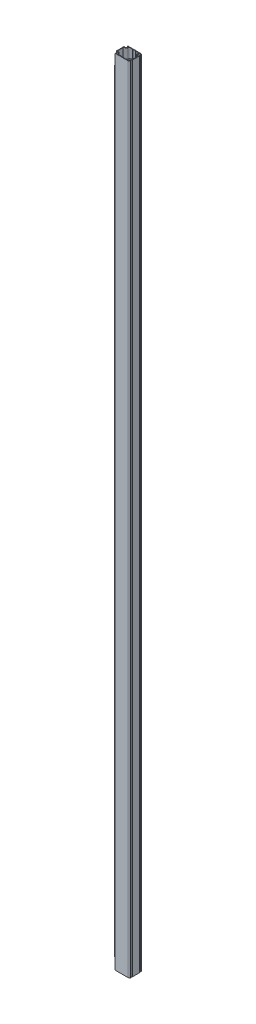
from build123d import *

# Parameters (mm, degrees)
SALIENTE_EXTRUIR2_DEPTH = 5000
CROQUIS3_W              = 12.11476064
CROQUIS3_H              = 9.5
CROQUIS3_W_2            = 14.082897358
CROQUIS3_H_2            = 15.016925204
CORTAR_EXTRUIR1_DEPTH   = 70
CROQUIS4_W              = 16.33693279
CROQUIS4_H              = 12.48072402
CROQUIS4_W_2            = 14.218786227
CROQUIS4_H_2            = 9.5
CORTAR_EXTRUIR2_DEPTH   = 70


with BuildPart() as part:
    # Croquis2 → Saliente-Extruir2 (new body)
    with BuildSketch(Plane(origin=(0, 0, 0), x_dir=(1, 0, 0), z_dir=(0, 1, 0))):
        with BuildLine():
            Line((40.5, 40), (-40.5, 40))
            ThreePointArc((-40.5, 40), (-46.389741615, 37.953921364), (-49.742457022, 32.69704078))
            ThreePointArc((-49.742457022, 32.69704078), (-48.630022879, 30.890804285), (-46.823786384, 32.003238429))
            ThreePointArc((-46.823786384, 32.003238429), (-34.495655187, 32.989546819), (-43.904761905, 24.96306977))
            ThreePointArc((-43.904761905, 24.96306977), (-47.951800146, 25.047214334), (-50, 21.55572809))
            Line((-50, 21.55572809), (-50, -21.55572809))
            ThreePointArc((-50, -21.55572809), (-47.951800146, -25.047214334), (-43.904761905, -24.96306977))
            ThreePointArc((-43.904761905, -24.96306977), (-34.495655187, -32.989546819), (-46.823786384, -32.003238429))
            ThreePointArc((-46.823786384, -32.003238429), (-48.630022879, -30.890804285), (-49.742457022, -32.69704078))
            ThreePointArc((-49.742457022, -32.69704078), (-46.389741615, -37.953921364), (-40.5, -40))
            Line((-40.5, -40), (40.5, -40))
            ThreePointArc((40.5, -40), (46.389741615, -37.953921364), (49.742457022, -32.69704078))
            ThreePointArc((49.742457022, -32.69704078), (48.630022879, -30.890804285), (46.823786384, -32.003238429))
            ThreePointArc((46.823786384, -32.003238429), (34.495655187, -32.989546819), (43.904761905, -24.96306977))
            ThreePointArc((43.904761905, -24.96306977), (47.951800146, -25.047214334), (50, -21.55572809))
            Line((50, -21.55572809), (50, 21.55572809))
            ThreePointArc((50, 21.55572809), (47.951800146, 25.047214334), (43.904761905, 24.96306977))
            ThreePointArc((43.904761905, 24.96306977), (34.495655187, 32.989546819), (46.823786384, 32.003238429))
            ThreePointArc((46.823786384, 32.003238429), (48.630022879, 30.890804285), (49.742457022, 32.69704078))
            ThreePointArc((49.742457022, 32.69704078), (46.389741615, 37.953921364), (40.5, 40))
        make_face()
        with BuildLine():
            Line((-11, 35.5), (-8, 35.5))
            Line((-8, 35.5), (-6.5, 37))
            Line((-6.5, 37), (6.5, 37))
            Line((6.5, 37), (8, 35.5))
            Line((8, 35.5), (11, 35.5))
            Line((11, 35.5), (12.5, 37))
            Line((12.5, 37), (24.5, 37))
            ThreePointArc((24.5, 37), (29.096194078, 35.096194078), (31, 30.5))
            ThreePointArc((31, 30.5), (33.782485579, 23.782485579), (40.5, 21))
            ThreePointArc((40.5, 21), (45.096194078, 19.096194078), (47, 14.5))
            Line((47, 14.5), (47, -14.5))
            ThreePointArc((47, -14.5), (45.096194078, -19.096194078), (40.5, -21))
            ThreePointArc((40.5, -21), (33.782485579, -23.782485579), (31, -30.5))
            ThreePointArc((31, -30.5), (29.096194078, -35.096194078), (24.5, -37))
            Line((24.5, -37), (12.5, -37))
            Line((12.5, -37), (11, -35.5))
            Line((11, -35.5), (8, -35.5))
            Line((8, -35.5), (6.5, -37))
            Line((6.5, -37), (-6.5, -37))
            Line((-6.5, -37), (-8, -35.5))
            Line((-8, -35.5), (-11, -35.5))
            Line((-11, -35.5), (-12.5, -37))
            Line((-12.5, -37), (-24.5, -37))
            ThreePointArc((-24.5, -37), (-29.096194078, -35.096194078), (-31, -30.5))
            ThreePointArc((-31, -30.5), (-33.782485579, -23.782485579), (-40.5, -21))
            ThreePointArc((-40.5, -21), (-45.096194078, -19.096194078), (-47, -14.5))
            Line((-47, -14.5), (-47, 14.5))
            ThreePointArc((-47, 14.5), (-45.096194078, 19.096194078), (-40.5, 21))
            ThreePointArc((-40.5, 21), (-33.782485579, 23.782485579), (-31, 30.5))
            ThreePointArc((-31, 30.5), (-29.096194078, 35.096194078), (-24.5, 37))
            Line((-24.5, 37), (-12.5, 37))
            Line((-12.5, 37), (-11, 35.5))
        make_face(mode=Mode.SUBTRACT)
    extrude(amount=SALIENTE_EXTRUIR2_DEPTH)

    # Croquis3 → Cortar-Extruir1 (cut)
    with BuildSketch(Plane(origin=(0, 5000, 0), x_dir=(1, 0, 0), z_dir=(0, 1, 0))):
        with Locations((-46.55738032, 35.25)):
            Rectangle(CROQUIS3_W, CROQUIS3_H)
        with Locations((-47.541448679, -38.008462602)):
            Rectangle(CROQUIS3_W_2, CROQUIS3_H_2)
    extrude(amount=-CORTAR_EXTRUIR1_DEPTH, mode=Mode.SUBTRACT)

    # Croquis4 → Cortar-Extruir2 (cut)
    with BuildSketch(Plane.XZ):
        with Locations((-48.668466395, -36.74036201)):
            Rectangle(CROQUIS4_W, CROQUIS4_H)
        with Locations((-47.609393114, 35.25)):
            Rectangle(CROQUIS4_W_2, CROQUIS4_H_2)
    extrude(amount=-CORTAR_EXTRUIR2_DEPTH, mode=Mode.SUBTRACT)


solid = part.part
